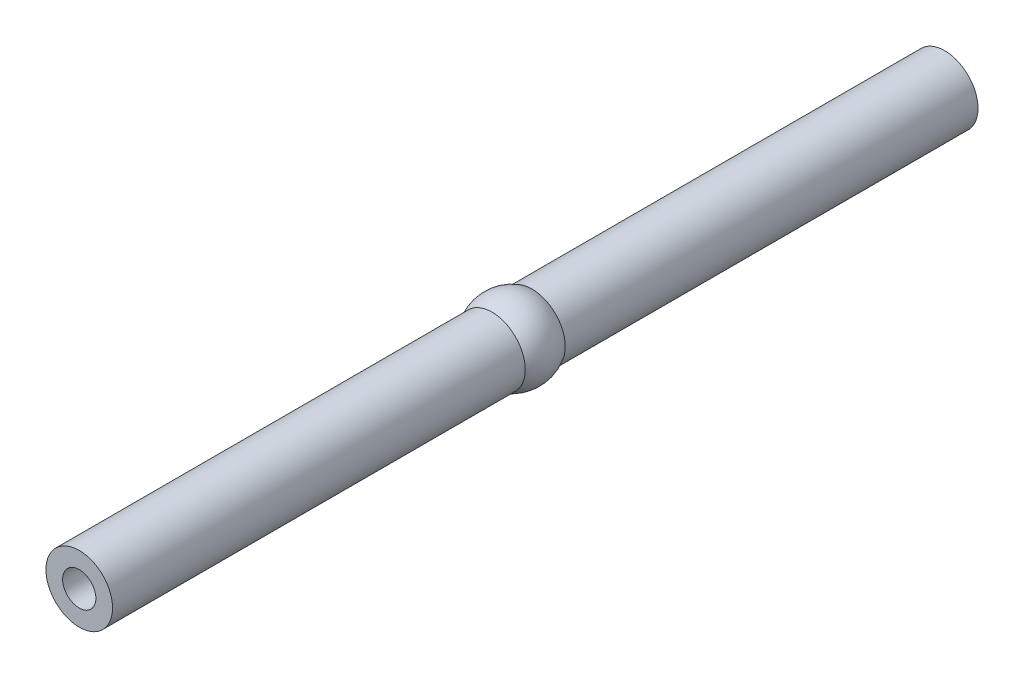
from build123d import *

# Parameters (mm, degrees)
ESQUISSE1_R             = 3
EXTRUSION1_DEPTH        = 39
ESQUISSE2_R             = 1.5
ENL_V_MAT_EXTRU_1_DEPTH = 10


with BuildPart() as part:
    # Esquisse1 → Extrusion1 (new, symmetric)
    with BuildSketch(Plane.XY):
        Circle(ESQUISSE1_R)
    extrude(amount=EXTRUSION1_DEPTH, both=True)

    # Esquisse2 → Enl_v. mat.-Extru.1 (cut)
    with BuildSketch(Plane.XY.offset(39)):
        Circle(ESQUISSE2_R)
    enl_v_mat_extru_1 = extrude(amount=-ENL_V_MAT_EXTRU_1_DEPTH, mode=Mode.SUBTRACT)

    # Sym_trie1: Enl_v. mat.-Extru.1 across plane
    add(enl_v_mat_extru_1.mirror(Plane.XY), mode=Mode.SUBTRACT)

    # Esquisse3 → R_volution1 (revolve)
    with BuildSketch(Plane(origin=(0, 0, 0), x_dir=(1, 0, 0), z_dir=(0, 1, 0))):
        with BuildLine():
            Line((0, 3.5), (0, -3.5))
            ThreePointArc((0, -3.5), (3.5, 0), (0, 3.5))
        make_face()
    revolve(axis=Axis((0, 0, -41.019136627), (0, 0, 1)))


solid = part.part
